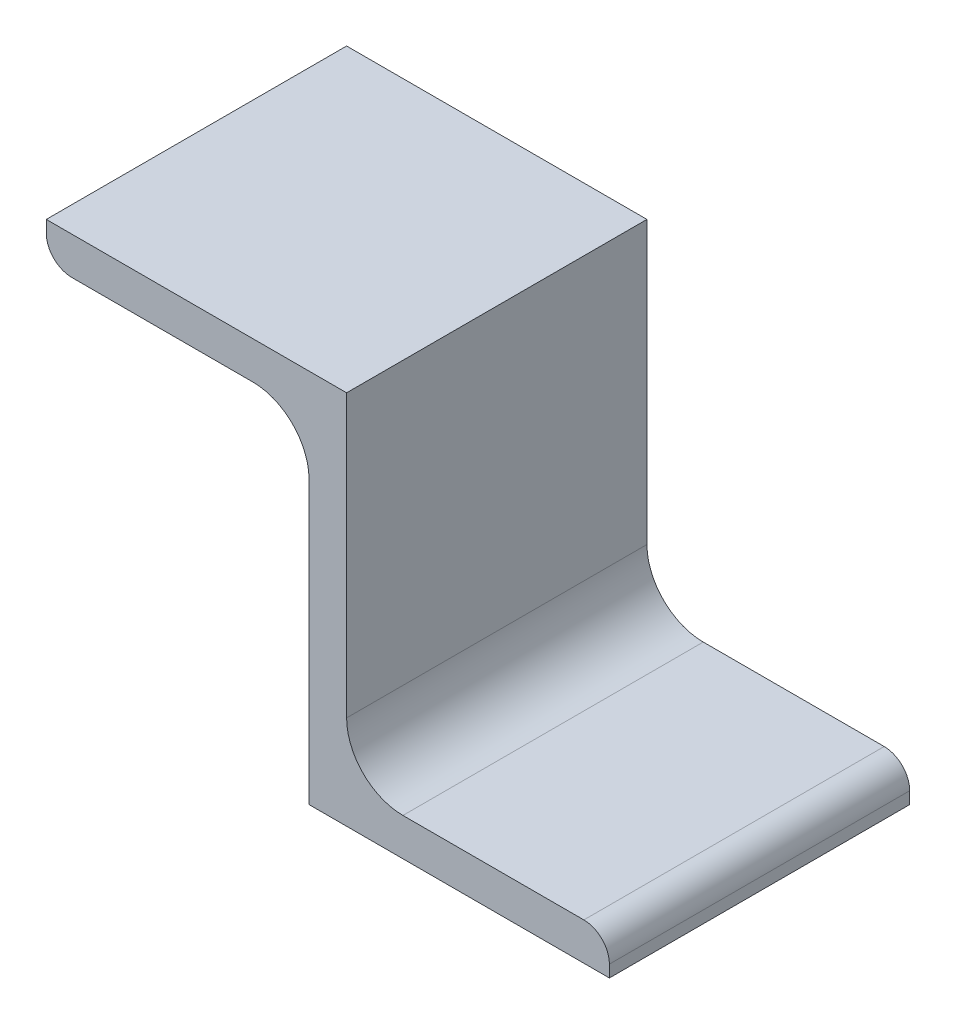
ISO-10303-21;
HEADER;
FILE_DESCRIPTION(('STEP AP214'),'2;1');
FILE_NAME('part.step','',(''),(''),'','','');
FILE_SCHEMA(('AUTOMOTIVE_DESIGN { 1 0 10303 214 1 1 1 1 }'));
ENDSEC;
DATA;
#1=APPLICATION_CONTEXT('core data for automotive mechanical design processes');
#2=APPLICATION_PROTOCOL_DEFINITION('international standard','automotive_design',2000,#1);
#3=PRODUCT_CONTEXT('',#1,'mechanical');
#4=PRODUCT('Part','Part','',(#3));
#5=PRODUCT_RELATED_PRODUCT_CATEGORY('part','',(#4));
#6=PRODUCT_DEFINITION_FORMATION('','',#4);
#7=PRODUCT_DEFINITION_CONTEXT('part definition',#1,'design');
#8=PRODUCT_DEFINITION('design','',#6,#7);
#9=PRODUCT_DEFINITION_SHAPE('','',#8);
#10=(LENGTH_UNIT() NAMED_UNIT(*) SI_UNIT(.MILLI.,.METRE.));
#11=(NAMED_UNIT(*) PLANE_ANGLE_UNIT() SI_UNIT($,.RADIAN.));
#12=(NAMED_UNIT(*) SI_UNIT($,.STERADIAN.) SOLID_ANGLE_UNIT());
#13=UNCERTAINTY_MEASURE_WITH_UNIT(LENGTH_MEASURE(1.E-05),#10,'distance_accuracy_value','');
#14=(GEOMETRIC_REPRESENTATION_CONTEXT(3) GLOBAL_UNCERTAINTY_ASSIGNED_CONTEXT((#13)) GLOBAL_UNIT_ASSIGNED_CONTEXT((#10,
#11,#12)) REPRESENTATION_CONTEXT('',''));
#15=CARTESIAN_POINT('',(0.,0.,0.));
#16=DIRECTION('',(0.,0.,1.));
#17=DIRECTION('',(1.,0.,0.));
#18=AXIS2_PLACEMENT_3D('',#15,#16,#17);
#19=CARTESIAN_POINT('',(0.,0.,12.7));
#20=DIRECTION('',(0.,1.,0.));
#21=DIRECTION('',(-1.,0.,0.));
#22=AXIS2_PLACEMENT_3D('',#19,#20,#21);
#23=PLANE('',#22);
#24=DIRECTION('',(1.,0.,0.));
#25=VECTOR('',#24,1.);
#26=CARTESIAN_POINT('',(0.,0.,-12.7));
#27=LINE('',#26,#25);
#28=CARTESIAN_POINT('',(0.,0.,-12.7));
#29=VERTEX_POINT('',#28);
#30=CARTESIAN_POINT('',(25.4,0.,-12.7));
#31=VERTEX_POINT('',#30);
#32=EDGE_CURVE('E155',#29,#31,#27,.T.);
#33=ORIENTED_EDGE('',*,*,#32,.T.);
#34=DIRECTION('',(0.,0.,-1.));
#35=VECTOR('',#34,1.);
#36=CARTESIAN_POINT('',(25.4,0.,12.7));
#37=LINE('',#36,#35);
#38=CARTESIAN_POINT('',(25.4,0.,12.7));
#39=VERTEX_POINT('',#38);
#40=EDGE_CURVE('E11',#39,#31,#37,.T.);
#41=ORIENTED_EDGE('',*,*,#40,.F.);
#42=DIRECTION('',(1.,0.,0.));
#43=VECTOR('',#42,1.);
#44=CARTESIAN_POINT('',(0.,0.,12.7));
#45=LINE('',#44,#43);
#46=CARTESIAN_POINT('',(0.,0.,12.7));
#47=VERTEX_POINT('',#46);
#48=EDGE_CURVE('E184',#47,#39,#45,.T.);
#49=ORIENTED_EDGE('',*,*,#48,.F.);
#50=DIRECTION('',(0.,0.,-1.));
#51=VECTOR('',#50,1.);
#52=CARTESIAN_POINT('',(0.,0.,12.7));
#53=LINE('',#52,#51);
#54=EDGE_CURVE('E49',#47,#29,#53,.T.);
#55=ORIENTED_EDGE('',*,*,#54,.T.);
#56=EDGE_LOOP('',(#33,#41,#49,#55));
#57=FACE_BOUND('',#56,.T.);
#58=ADVANCED_FACE('F33',(#57),#23,.F.);
#59=CARTESIAN_POINT('',(25.4,0.,12.7));
#60=DIRECTION('',(-1.,0.,0.));
#61=DIRECTION('',(0.,-1.,0.));
#62=AXIS2_PLACEMENT_3D('',#59,#60,#61);
#63=PLANE('',#62);
#64=DIRECTION('',(0.,1.,0.));
#65=VECTOR('',#64,1.);
#66=CARTESIAN_POINT('',(25.4,0.,-12.7));
#67=LINE('',#66,#65);
#68=CARTESIAN_POINT('',(25.4,1.016,-12.7));
#69=VERTEX_POINT('',#68);
#70=EDGE_CURVE('E157',#31,#69,#67,.T.);
#71=ORIENTED_EDGE('',*,*,#70,.T.);
#72=DIRECTION('',(0.,0.,-1.));
#73=VECTOR('',#72,1.);
#74=CARTESIAN_POINT('',(25.4,1.016,12.7));
#75=LINE('',#74,#73);
#76=CARTESIAN_POINT('',(25.4,1.016,12.7));
#77=VERTEX_POINT('',#76);
#78=EDGE_CURVE('E41',#77,#69,#75,.T.);
#79=ORIENTED_EDGE('',*,*,#78,.F.);
#80=DIRECTION('',(0.,1.,0.));
#81=VECTOR('',#80,1.);
#82=CARTESIAN_POINT('',(25.4,0.,12.7));
#83=LINE('',#82,#81);
#84=EDGE_CURVE('E99',#39,#77,#83,.T.);
#85=ORIENTED_EDGE('',*,*,#84,.F.);
#86=ORIENTED_EDGE('',*,*,#40,.T.);
#87=EDGE_LOOP('',(#71,#79,#85,#86));
#88=FACE_BOUND('',#87,.T.);
#89=ADVANCED_FACE('F253',(#88),#63,.F.);
#90=CARTESIAN_POINT('',(23.241,1.016,12.7));
#91=DIRECTION('',(0.,0.,-1.));
#92=DIRECTION('',(-1.,0.,0.));
#93=AXIS2_PLACEMENT_3D('',#90,#91,#92);
#94=CYLINDRICAL_SURFACE('',#93,2.159);
#95=CARTESIAN_POINT('',(23.241,1.016,-12.7));
#96=DIRECTION('',(0.,0.,1.));
#97=DIRECTION('',(1.,0.,0.));
#98=AXIS2_PLACEMENT_3D('',#95,#96,#97);
#99=CIRCLE('',#98,2.159);
#100=CARTESIAN_POINT('',(23.241,3.175,-12.7));
#101=VERTEX_POINT('',#100);
#102=EDGE_CURVE('E159',#69,#101,#99,.T.);
#103=ORIENTED_EDGE('',*,*,#102,.T.);
#104=DIRECTION('',(0.,0.,-1.));
#105=VECTOR('',#104,1.);
#106=CARTESIAN_POINT('',(23.241,3.175,12.7));
#107=LINE('',#106,#105);
#108=CARTESIAN_POINT('',(23.241,3.175,12.7));
#109=VERTEX_POINT('',#108);
#110=EDGE_CURVE('E198',#109,#101,#107,.T.);
#111=ORIENTED_EDGE('',*,*,#110,.F.);
#112=CARTESIAN_POINT('',(23.241,1.016,12.7));
#113=DIRECTION('',(0.,0.,1.));
#114=DIRECTION('',(1.,0.,0.));
#115=AXIS2_PLACEMENT_3D('',#112,#113,#114);
#116=CIRCLE('',#115,2.159);
#117=EDGE_CURVE('E206',#77,#109,#116,.T.);
#118=ORIENTED_EDGE('',*,*,#117,.F.);
#119=ORIENTED_EDGE('',*,*,#78,.T.);
#120=EDGE_LOOP('',(#103,#111,#118,#119));
#121=FACE_BOUND('',#120,.T.);
#122=ADVANCED_FACE('F204',(#121),#94,.T.);
#123=CARTESIAN_POINT('',(23.241,3.175,12.7));
#124=DIRECTION('',(0.,-1.,0.));
#125=DIRECTION('',(1.,0.,0.));
#126=AXIS2_PLACEMENT_3D('',#123,#124,#125);
#127=PLANE('',#126);
#128=DIRECTION('',(-1.,0.,0.));
#129=VECTOR('',#128,1.);
#130=CARTESIAN_POINT('',(23.241,3.175,-12.7));
#131=LINE('',#130,#129);
#132=CARTESIAN_POINT('',(7.9375,3.175,-12.7));
#133=VERTEX_POINT('',#132);
#134=EDGE_CURVE('E161',#101,#133,#131,.T.);
#135=ORIENTED_EDGE('',*,*,#134,.T.);
#136=DIRECTION('',(0.,0.,-1.));
#137=VECTOR('',#136,1.);
#138=CARTESIAN_POINT('',(7.9375,3.175,12.7));
#139=LINE('',#138,#137);
#140=CARTESIAN_POINT('',(7.9375,3.175,12.7));
#141=VERTEX_POINT('',#140);
#142=EDGE_CURVE('E196',#141,#133,#139,.T.);
#143=ORIENTED_EDGE('',*,*,#142,.F.);
#144=DIRECTION('',(-1.,0.,0.));
#145=VECTOR('',#144,1.);
#146=CARTESIAN_POINT('',(23.241,3.175,12.7));
#147=LINE('',#146,#145);
#148=EDGE_CURVE('E216',#109,#141,#147,.T.);
#149=ORIENTED_EDGE('',*,*,#148,.F.);
#150=ORIENTED_EDGE('',*,*,#110,.T.);
#151=EDGE_LOOP('',(#135,#143,#149,#150));
#152=FACE_BOUND('',#151,.T.);
#153=ADVANCED_FACE('F213',(#152),#127,.F.);
#154=CARTESIAN_POINT('',(7.9375,7.9375,12.7));
#155=DIRECTION('',(0.,0.,-1.));
#156=DIRECTION('',(-1.,0.,0.));
#157=AXIS2_PLACEMENT_3D('',#154,#155,#156);
#158=CYLINDRICAL_SURFACE('',#157,4.7625);
#159=CARTESIAN_POINT('',(7.9375,7.9375,-12.7));
#160=DIRECTION('',(0.,0.,1.));
#161=DIRECTION('',(1.,0.,0.));
#162=AXIS2_PLACEMENT_3D('',#159,#160,#161);
#163=CIRCLE('',#162,4.7625);
#164=CARTESIAN_POINT('',(3.175,7.93749999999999,-12.7));
#165=VERTEX_POINT('',#164);
#166=EDGE_CURVE('E164',#165,#133,#163,.T.);
#167=ORIENTED_EDGE('',*,*,#166,.F.);
#168=DIRECTION('',(0.,0.,-1.));
#169=VECTOR('',#168,1.);
#170=CARTESIAN_POINT('',(3.175,7.93749999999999,12.7));
#171=LINE('',#170,#169);
#172=CARTESIAN_POINT('',(3.175,7.93749999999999,12.7));
#173=VERTEX_POINT('',#172);
#174=EDGE_CURVE('E194',#173,#165,#171,.T.);
#175=ORIENTED_EDGE('',*,*,#174,.F.);
#176=CARTESIAN_POINT('',(7.9375,7.9375,12.7));
#177=DIRECTION('',(0.,0.,1.));
#178=DIRECTION('',(1.,0.,0.));
#179=AXIS2_PLACEMENT_3D('',#176,#177,#178);
#180=CIRCLE('',#179,4.7625);
#181=EDGE_CURVE('E218',#173,#141,#180,.T.);
#182=ORIENTED_EDGE('',*,*,#181,.T.);
#183=ORIENTED_EDGE('',*,*,#142,.T.);
#184=EDGE_LOOP('',(#167,#175,#182,#183));
#185=FACE_BOUND('',#184,.T.);
#186=ADVANCED_FACE('F319',(#185),#158,.F.);
#187=CARTESIAN_POINT('',(3.17499999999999,31.75,12.7));
#188=DIRECTION('',(1.,0.,0.));
#189=DIRECTION('',(0.,1.,0.));
#190=AXIS2_PLACEMENT_3D('',#187,#188,#189);
#191=PLANE('',#190);
#192=DIRECTION('',(0.,-1.,0.));
#193=VECTOR('',#192,1.);
#194=CARTESIAN_POINT('',(3.17499999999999,31.75,-12.7));
#195=LINE('',#194,#193);
#196=CARTESIAN_POINT('',(3.17499999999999,31.75,-12.7));
#197=VERTEX_POINT('',#196);
#198=EDGE_CURVE('E167',#197,#165,#195,.T.);
#199=ORIENTED_EDGE('',*,*,#198,.F.);
#200=DIRECTION('',(0.,0.,-1.));
#201=VECTOR('',#200,1.);
#202=CARTESIAN_POINT('',(3.17499999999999,31.75,12.7));
#203=LINE('',#202,#201);
#204=CARTESIAN_POINT('',(3.17499999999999,31.75,12.7));
#205=VERTEX_POINT('',#204);
#206=EDGE_CURVE('E192',#205,#197,#203,.T.);
#207=ORIENTED_EDGE('',*,*,#206,.F.);
#208=DIRECTION('',(0.,-1.,0.));
#209=VECTOR('',#208,1.);
#210=CARTESIAN_POINT('',(3.17499999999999,31.75,12.7));
#211=LINE('',#210,#209);
#212=EDGE_CURVE('E220',#205,#173,#211,.T.);
#213=ORIENTED_EDGE('',*,*,#212,.T.);
#214=ORIENTED_EDGE('',*,*,#174,.T.);
#215=EDGE_LOOP('',(#199,#207,#213,#214));
#216=FACE_BOUND('',#215,.T.);
#217=ADVANCED_FACE('F310',(#216),#191,.T.);
#218=CARTESIAN_POINT('',(-22.225,31.75,12.7));
#219=DIRECTION('',(0.,1.,0.));
#220=DIRECTION('',(-1.,0.,0.));
#221=AXIS2_PLACEMENT_3D('',#218,#219,#220);
#222=PLANE('',#221);
#223=DIRECTION('',(1.,0.,0.));
#224=VECTOR('',#223,1.);
#225=CARTESIAN_POINT('',(-22.225,31.75,-12.7));
#226=LINE('',#225,#224);
#227=CARTESIAN_POINT('',(-22.225,31.75,-12.7));
#228=VERTEX_POINT('',#227);
#229=EDGE_CURVE('E170',#228,#197,#226,.T.);
#230=ORIENTED_EDGE('',*,*,#229,.F.);
#231=DIRECTION('',(0.,0.,-1.));
#232=VECTOR('',#231,1.);
#233=CARTESIAN_POINT('',(-22.225,31.75,12.7));
#234=LINE('',#233,#232);
#235=CARTESIAN_POINT('',(-22.225,31.75,12.7));
#236=VERTEX_POINT('',#235);
#237=EDGE_CURVE('E190',#236,#228,#234,.T.);
#238=ORIENTED_EDGE('',*,*,#237,.F.);
#239=DIRECTION('',(1.,0.,0.));
#240=VECTOR('',#239,1.);
#241=CARTESIAN_POINT('',(-22.225,31.75,12.7));
#242=LINE('',#241,#240);
#243=EDGE_CURVE('E227',#236,#205,#242,.T.);
#244=ORIENTED_EDGE('',*,*,#243,.T.);
#245=ORIENTED_EDGE('',*,*,#206,.T.);
#246=EDGE_LOOP('',(#230,#238,#244,#245));
#247=FACE_BOUND('',#246,.T.);
#248=ADVANCED_FACE('F239',(#247),#222,.T.);
#249=CARTESIAN_POINT('',(-22.225,30.734,12.7));
#250=DIRECTION('',(-1.,0.,0.));
#251=DIRECTION('',(0.,0.,1.));
#252=AXIS2_PLACEMENT_3D('',#249,#250,#251);
#253=PLANE('',#252);
#254=DIRECTION('',(0.,1.,0.));
#255=VECTOR('',#254,1.);
#256=CARTESIAN_POINT('',(-22.225,30.734,-12.7));
#257=LINE('',#256,#255);
#258=CARTESIAN_POINT('',(-22.225,30.734,-12.7));
#259=VERTEX_POINT('',#258);
#260=EDGE_CURVE('E173',#259,#228,#257,.T.);
#261=ORIENTED_EDGE('',*,*,#260,.F.);
#262=DIRECTION('',(0.,0.,-1.));
#263=VECTOR('',#262,1.);
#264=CARTESIAN_POINT('',(-22.225,30.734,12.7));
#265=LINE('',#264,#263);
#266=CARTESIAN_POINT('',(-22.225,30.734,12.7));
#267=VERTEX_POINT('',#266);
#268=EDGE_CURVE('E188',#267,#259,#265,.T.);
#269=ORIENTED_EDGE('',*,*,#268,.F.);
#270=DIRECTION('',(0.,1.,0.));
#271=VECTOR('',#270,1.);
#272=CARTESIAN_POINT('',(-22.225,30.734,12.7));
#273=LINE('',#272,#271);
#274=EDGE_CURVE('E230',#267,#236,#273,.T.);
#275=ORIENTED_EDGE('',*,*,#274,.T.);
#276=ORIENTED_EDGE('',*,*,#237,.T.);
#277=EDGE_LOOP('',(#261,#269,#275,#276));
#278=FACE_BOUND('',#277,.T.);
#279=ADVANCED_FACE('F234',(#278),#253,.T.);
#280=CARTESIAN_POINT('',(-20.066,30.734,12.7));
#281=DIRECTION('',(0.,0.,-1.));
#282=DIRECTION('',(-1.,0.,0.));
#283=AXIS2_PLACEMENT_3D('',#280,#281,#282);
#284=CYLINDRICAL_SURFACE('',#283,2.159);
#285=CARTESIAN_POINT('',(-20.066,30.734,-12.7));
#286=DIRECTION('',(0.,0.,1.));
#287=DIRECTION('',(1.,0.,0.));
#288=AXIS2_PLACEMENT_3D('',#285,#286,#287);
#289=CIRCLE('',#288,2.159);
#290=CARTESIAN_POINT('',(-20.066,28.575,-12.7));
#291=VERTEX_POINT('',#290);
#292=EDGE_CURVE('E176',#259,#291,#289,.T.);
#293=ORIENTED_EDGE('',*,*,#292,.T.);
#294=DIRECTION('',(0.,0.,-1.));
#295=VECTOR('',#294,1.);
#296=CARTESIAN_POINT('',(-20.066,28.575,12.7));
#297=LINE('',#296,#295);
#298=CARTESIAN_POINT('',(-20.066,28.575,12.7));
#299=VERTEX_POINT('',#298);
#300=EDGE_CURVE('E147',#299,#291,#297,.T.);
#301=ORIENTED_EDGE('',*,*,#300,.F.);
#302=CARTESIAN_POINT('',(-20.066,30.734,12.7));
#303=DIRECTION('',(0.,0.,1.));
#304=DIRECTION('',(1.,0.,0.));
#305=AXIS2_PLACEMENT_3D('',#302,#303,#304);
#306=CIRCLE('',#305,2.159);
#307=EDGE_CURVE('E135',#267,#299,#306,.T.);
#308=ORIENTED_EDGE('',*,*,#307,.F.);
#309=ORIENTED_EDGE('',*,*,#268,.T.);
#310=EDGE_LOOP('',(#293,#301,#308,#309));
#311=FACE_BOUND('',#310,.T.);
#312=ADVANCED_FACE('F243',(#311),#284,.T.);
#313=CARTESIAN_POINT('',(-20.066,28.575,12.7));
#314=DIRECTION('',(0.,1.,0.));
#315=DIRECTION('',(-1.,0.,0.));
#316=AXIS2_PLACEMENT_3D('',#313,#314,#315);
#317=PLANE('',#316);
#318=DIRECTION('',(1.,0.,0.));
#319=VECTOR('',#318,1.);
#320=CARTESIAN_POINT('',(-20.066,28.575,-12.7));
#321=LINE('',#320,#319);
#322=CARTESIAN_POINT('',(-4.76250000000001,28.575,-12.7));
#323=VERTEX_POINT('',#322);
#324=EDGE_CURVE('E144',#291,#323,#321,.T.);
#325=ORIENTED_EDGE('',*,*,#324,.T.);
#326=DIRECTION('',(0.,0.,-1.));
#327=VECTOR('',#326,1.);
#328=CARTESIAN_POINT('',(-4.76250000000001,28.575,12.7));
#329=LINE('',#328,#327);
#330=CARTESIAN_POINT('',(-4.76250000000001,28.575,12.7));
#331=VERTEX_POINT('',#330);
#332=EDGE_CURVE('E141',#331,#323,#329,.T.);
#333=ORIENTED_EDGE('',*,*,#332,.F.);
#334=DIRECTION('',(1.,0.,0.));
#335=VECTOR('',#334,1.);
#336=CARTESIAN_POINT('',(-20.066,28.575,12.7));
#337=LINE('',#336,#335);
#338=EDGE_CURVE('E127',#299,#331,#337,.T.);
#339=ORIENTED_EDGE('',*,*,#338,.F.);
#340=ORIENTED_EDGE('',*,*,#300,.T.);
#341=EDGE_LOOP('',(#325,#333,#339,#340));
#342=FACE_BOUND('',#341,.T.);
#343=ADVANCED_FACE('F142',(#342),#317,.F.);
#344=CARTESIAN_POINT('',(-4.76250000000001,23.8125,12.7));
#345=DIRECTION('',(0.,0.,-1.));
#346=DIRECTION('',(-1.,0.,0.));
#347=AXIS2_PLACEMENT_3D('',#344,#345,#346);
#348=CYLINDRICAL_SURFACE('',#347,4.7625);
#349=CARTESIAN_POINT('',(-4.76250000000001,23.8125,-12.7));
#350=DIRECTION('',(0.,0.,1.));
#351=DIRECTION('',(1.,0.,0.));
#352=AXIS2_PLACEMENT_3D('',#349,#350,#351);
#353=CIRCLE('',#352,4.7625);
#354=CARTESIAN_POINT('',(0.,23.8125,-12.7));
#355=VERTEX_POINT('',#354);
#356=EDGE_CURVE('E179',#355,#323,#353,.T.);
#357=ORIENTED_EDGE('',*,*,#356,.F.);
#358=DIRECTION('',(0.,0.,-1.));
#359=VECTOR('',#358,1.);
#360=CARTESIAN_POINT('',(0.,23.8125,12.7));
#361=LINE('',#360,#359);
#362=CARTESIAN_POINT('',(0.,23.8125,12.7));
#363=VERTEX_POINT('',#362);
#364=EDGE_CURVE('E87',#363,#355,#361,.T.);
#365=ORIENTED_EDGE('',*,*,#364,.F.);
#366=CARTESIAN_POINT('',(-4.76250000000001,23.8125,12.7));
#367=DIRECTION('',(0.,0.,1.));
#368=DIRECTION('',(1.,0.,0.));
#369=AXIS2_PLACEMENT_3D('',#366,#367,#368);
#370=CIRCLE('',#369,4.7625);
#371=EDGE_CURVE('E132',#363,#331,#370,.T.);
#372=ORIENTED_EDGE('',*,*,#371,.T.);
#373=ORIENTED_EDGE('',*,*,#332,.T.);
#374=EDGE_LOOP('',(#357,#365,#372,#373));
#375=FACE_BOUND('',#374,.T.);
#376=ADVANCED_FACE('F149',(#375),#348,.F.);
#377=CARTESIAN_POINT('',(0.,0.,12.7));
#378=DIRECTION('',(-1.,0.,0.));
#379=DIRECTION('',(0.,-1.,0.));
#380=AXIS2_PLACEMENT_3D('',#377,#378,#379);
#381=PLANE('',#380);
#382=DIRECTION('',(0.,1.,0.));
#383=VECTOR('',#382,1.);
#384=CARTESIAN_POINT('',(0.,0.,-12.7));
#385=LINE('',#384,#383);
#386=EDGE_CURVE('E181',#29,#355,#385,.T.);
#387=ORIENTED_EDGE('',*,*,#386,.F.);
#388=ORIENTED_EDGE('',*,*,#54,.F.);
#389=DIRECTION('',(0.,1.,0.));
#390=VECTOR('',#389,1.);
#391=CARTESIAN_POINT('',(0.,0.,12.7));
#392=LINE('',#391,#390);
#393=EDGE_CURVE('E150',#47,#363,#392,.T.);
#394=ORIENTED_EDGE('',*,*,#393,.T.);
#395=ORIENTED_EDGE('',*,*,#364,.T.);
#396=EDGE_LOOP('',(#387,#388,#394,#395));
#397=FACE_BOUND('',#396,.T.);
#398=ADVANCED_FACE('F258',(#397),#381,.T.);
#399=CARTESIAN_POINT('',(23.241,1.016,12.7));
#400=DIRECTION('',(0.,0.,1.));
#401=DIRECTION('',(1.,0.,0.));
#402=AXIS2_PLACEMENT_3D('',#399,#400,#401);
#403=PLANE('',#402);
#404=ORIENTED_EDGE('',*,*,#48,.T.);
#405=ORIENTED_EDGE('',*,*,#84,.T.);
#406=ORIENTED_EDGE('',*,*,#117,.T.);
#407=ORIENTED_EDGE('',*,*,#148,.T.);
#408=ORIENTED_EDGE('',*,*,#181,.F.);
#409=ORIENTED_EDGE('',*,*,#212,.F.);
#410=ORIENTED_EDGE('',*,*,#243,.F.);
#411=ORIENTED_EDGE('',*,*,#274,.F.);
#412=ORIENTED_EDGE('',*,*,#307,.T.);
#413=ORIENTED_EDGE('',*,*,#338,.T.);
#414=ORIENTED_EDGE('',*,*,#371,.F.);
#415=ORIENTED_EDGE('',*,*,#393,.F.);
#416=EDGE_LOOP('',(#404,#405,#406,#407,#408,#409,#410,#411,#412,#413,#414,#415));
#417=FACE_BOUND('',#416,.T.);
#418=ADVANCED_FACE('F129',(#417),#403,.T.);
#419=CARTESIAN_POINT('',(23.241,1.016,-12.7));
#420=DIRECTION('',(0.,0.,1.));
#421=DIRECTION('',(1.,0.,0.));
#422=AXIS2_PLACEMENT_3D('',#419,#420,#421);
#423=PLANE('',#422);
#424=ORIENTED_EDGE('',*,*,#32,.F.);
#425=ORIENTED_EDGE('',*,*,#386,.T.);
#426=ORIENTED_EDGE('',*,*,#356,.T.);
#427=ORIENTED_EDGE('',*,*,#324,.F.);
#428=ORIENTED_EDGE('',*,*,#292,.F.);
#429=ORIENTED_EDGE('',*,*,#260,.T.);
#430=ORIENTED_EDGE('',*,*,#229,.T.);
#431=ORIENTED_EDGE('',*,*,#198,.T.);
#432=ORIENTED_EDGE('',*,*,#166,.T.);
#433=ORIENTED_EDGE('',*,*,#134,.F.);
#434=ORIENTED_EDGE('',*,*,#102,.F.);
#435=ORIENTED_EDGE('',*,*,#70,.F.);
#436=EDGE_LOOP('',(#424,#425,#426,#427,#428,#429,#430,#431,#432,#433,#434,#435));
#437=FACE_BOUND('',#436,.T.);
#438=ADVANCED_FACE('F209',(#437),#423,.F.);
#439=CLOSED_SHELL('',(#58,#89,#122,#153,#186,#217,#248,#279,#312,#343,#376,#398,#418,#438));
#440=MANIFOLD_SOLID_BREP('B2',#439);
#441=ADVANCED_BREP_SHAPE_REPRESENTATION('',(#18,#440),#14);
#442=SHAPE_DEFINITION_REPRESENTATION(#9,#441);
ENDSEC;
END-ISO-10303-21;
